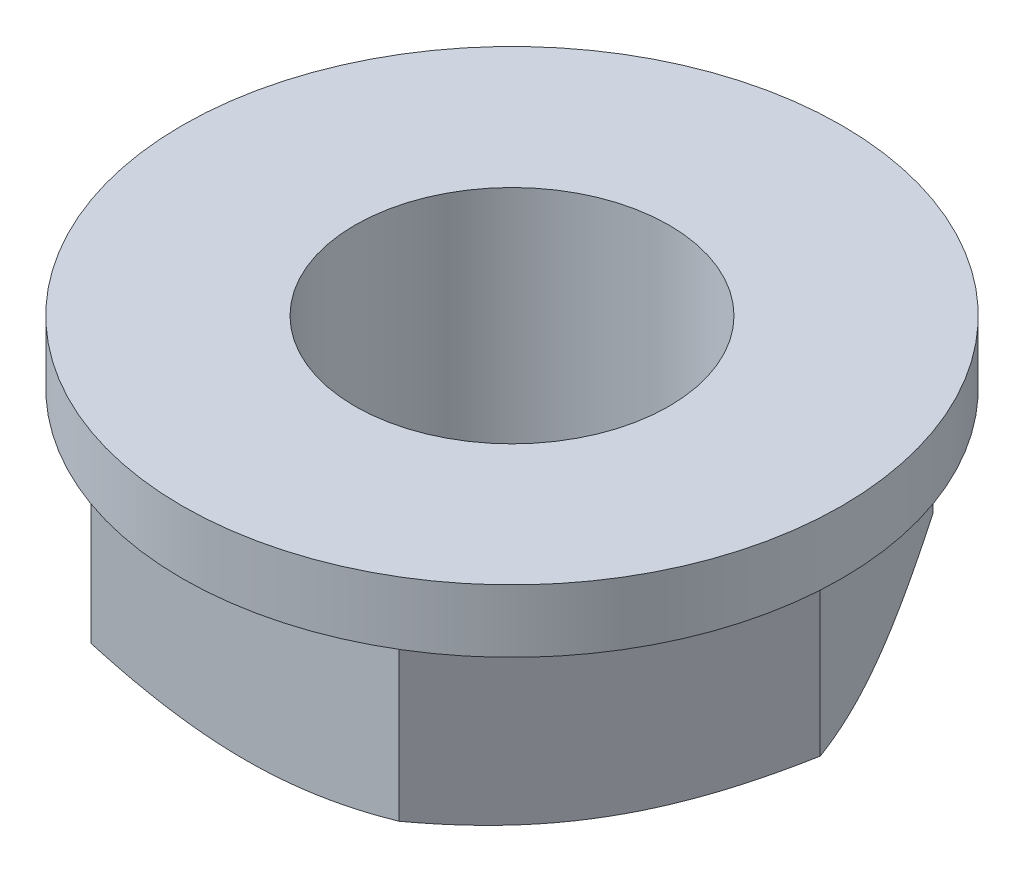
ISO-10303-21;
HEADER;
FILE_DESCRIPTION(('STEP AP214'),'2;1');
FILE_NAME('part.step','',(''),(''),'','','');
FILE_SCHEMA(('AUTOMOTIVE_DESIGN { 1 0 10303 214 1 1 1 1 }'));
ENDSEC;
DATA;
#1=APPLICATION_CONTEXT('core data for automotive mechanical design processes');
#2=APPLICATION_PROTOCOL_DEFINITION('international standard','automotive_design',2000,#1);
#3=PRODUCT_CONTEXT('',#1,'mechanical');
#4=PRODUCT('Part','Part','',(#3));
#5=PRODUCT_RELATED_PRODUCT_CATEGORY('part','',(#4));
#6=PRODUCT_DEFINITION_FORMATION('','',#4);
#7=PRODUCT_DEFINITION_CONTEXT('part definition',#1,'design');
#8=PRODUCT_DEFINITION('design','',#6,#7);
#9=PRODUCT_DEFINITION_SHAPE('','',#8);
#10=(LENGTH_UNIT() NAMED_UNIT(*) SI_UNIT(.MILLI.,.METRE.));
#11=(NAMED_UNIT(*) PLANE_ANGLE_UNIT() SI_UNIT($,.RADIAN.));
#12=(NAMED_UNIT(*) SI_UNIT($,.STERADIAN.) SOLID_ANGLE_UNIT());
#13=UNCERTAINTY_MEASURE_WITH_UNIT(LENGTH_MEASURE(1.E-05),#10,'distance_accuracy_value','');
#14=(GEOMETRIC_REPRESENTATION_CONTEXT(3) GLOBAL_UNCERTAINTY_ASSIGNED_CONTEXT((#13)) GLOBAL_UNIT_ASSIGNED_CONTEXT((#10,
#11,#12)) REPRESENTATION_CONTEXT('',''));
#15=CARTESIAN_POINT('',(0.,0.,0.));
#16=DIRECTION('',(0.,0.,1.));
#17=DIRECTION('',(1.,0.,0.));
#18=AXIS2_PLACEMENT_3D('',#15,#16,#17);
#19=CARTESIAN_POINT('',(0.,-7.6196705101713,0.));
#20=DIRECTION('',(0.,1.,0.));
#21=DIRECTION('',(-1.,0.,0.));
#22=AXIS2_PLACEMENT_3D('',#19,#20,#21);
#23=CONICAL_SURFACE('',#22,9.15875,1.0471975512);
#24=CARTESIAN_POINT('',(7.36121593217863,-8.00000000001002,-4.25000000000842));
#25=CARTESIAN_POINT('',(8.50000000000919,-8.00000000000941,-2.27756813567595));
#26=CARTESIAN_POINT('',(9.81495457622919,-7.24081062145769,2.25340941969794E-12));
#27=(BOUNDED_CURVE() B_SPLINE_CURVE(2,(#24,#25,#26),.UNSPECIFIED.,.F.,
.F.) B_SPLINE_CURVE_WITH_KNOTS((3,3),(4.98381893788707,9.96299728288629),
.UNSPECIFIED.) CURVE() GEOMETRIC_REPRESENTATION_ITEM() RATIONAL_B_SPLINE_CURVE((1.00000000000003,
1.03799156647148,1.00007075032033)) REPRESENTATION_ITEM(''));
#28=CARTESIAN_POINT('',(7.36121593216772,-8.,-4.25));
#29=VERTEX_POINT('',#28);
#30=CARTESIAN_POINT('',(9.81495457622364,-7.2408106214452,0.));
#31=VERTEX_POINT('',#30);
#32=EDGE_CURVE('E30',#29,#31,#27,.T.);
#33=ORIENTED_EDGE('',*,*,#32,.T.);
#34=CARTESIAN_POINT('',(9.81495457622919,-7.24081062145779,-2.25483529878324E-12));
#35=CARTESIAN_POINT('',(8.50000000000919,-8.0000000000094,2.27756813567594));
#36=CARTESIAN_POINT('',(7.36121593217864,-8.00000000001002,4.25000000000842));
#37=(BOUNDED_CURVE() B_SPLINE_CURVE(2,(#34,#35,#36),.UNSPECIFIED.,.F.,
.F.) B_SPLINE_CURVE_WITH_KNOTS((3,3),(0.00464059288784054,4.98381893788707),
.UNSPECIFIED.) CURVE() GEOMETRIC_REPRESENTATION_ITEM() RATIONAL_B_SPLINE_CURVE((1.00007075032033,
1.03799156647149,1.00000000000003)) REPRESENTATION_ITEM(''));
#38=CARTESIAN_POINT('',(7.36121593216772,-8.,4.25));
#39=VERTEX_POINT('',#38);
#40=EDGE_CURVE('E146',#31,#39,#37,.T.);
#41=ORIENTED_EDGE('',*,*,#40,.T.);
#42=CARTESIAN_POINT('',(0.,-8.00000000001,0.));
#43=DIRECTION('',(0.,-1.,0.));
#44=DIRECTION('',(-1.,0.,0.));
#45=AXIS2_PLACEMENT_3D('',#42,#43,#44);
#46=CIRCLE('',#45,8.5);
#47=EDGE_CURVE('E22',#29,#39,#46,.T.);
#48=ORIENTED_EDGE('',*,*,#47,.F.);
#49=EDGE_LOOP('',(#33,#41,#48));
#50=FACE_BOUND('',#49,.T.);
#51=ADVANCED_FACE('F18',(#50),#23,.T.);
#52=CARTESIAN_POINT('',(-7.36121593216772,-8.,4.25));
#53=VERTEX_POINT('',#52);
#54=CARTESIAN_POINT('',(-7.36121593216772,-8.,-4.25));
#55=VERTEX_POINT('',#54);
#56=EDGE_CURVE('E145',#53,#55,#46,.T.);
#57=ORIENTED_EDGE('',*,*,#56,.F.);
#58=CARTESIAN_POINT('',(-7.36121593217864,-8.00000000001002,4.25000000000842));
#59=CARTESIAN_POINT('',(-8.50000000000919,-8.00000000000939,2.27756813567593));
#60=CARTESIAN_POINT('',(-9.81495457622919,-7.24081062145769,-2.25649494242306E-12));
#61=(BOUNDED_CURVE() B_SPLINE_CURVE(2,(#58,#59,#60),.UNSPECIFIED.,.F.,
.F.) B_SPLINE_CURVE_WITH_KNOTS((3,3),(4.98381893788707,9.9629972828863),
.UNSPECIFIED.) CURVE() GEOMETRIC_REPRESENTATION_ITEM() RATIONAL_B_SPLINE_CURVE((1.00000000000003,
1.0379915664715,1.00007075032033)) REPRESENTATION_ITEM(''));
#62=CARTESIAN_POINT('',(-9.81495457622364,-7.2408106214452,0.));
#63=VERTEX_POINT('',#62);
#64=EDGE_CURVE('E131',#53,#63,#61,.T.);
#65=ORIENTED_EDGE('',*,*,#64,.T.);
#66=CARTESIAN_POINT('',(-9.81495457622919,-7.24081062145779,2.25307782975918E-12));
#67=CARTESIAN_POINT('',(-8.50000000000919,-8.0000000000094,-2.27756813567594));
#68=CARTESIAN_POINT('',(-7.36121593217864,-8.00000000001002,-4.25000000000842));
#69=(BOUNDED_CURVE() B_SPLINE_CURVE(2,(#66,#67,#68),.UNSPECIFIED.,.F.,
.F.) B_SPLINE_CURVE_WITH_KNOTS((3,3),(0.00464059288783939,4.98381893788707),
.UNSPECIFIED.) CURVE() GEOMETRIC_REPRESENTATION_ITEM() RATIONAL_B_SPLINE_CURVE((1.00007075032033,
1.03799156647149,1.00000000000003)) REPRESENTATION_ITEM(''));
#70=EDGE_CURVE('E39',#63,#55,#69,.T.);
#71=ORIENTED_EDGE('',*,*,#70,.T.);
#72=EDGE_LOOP('',(#57,#65,#71));
#73=FACE_BOUND('',#72,.T.);
#74=ADVANCED_FACE('F20',(#73),#23,.T.);
#75=CARTESIAN_POINT('',(0.,-1.,0.));
#76=DIRECTION('',(0.,-1.,0.));
#77=DIRECTION('',(1.,0.,0.));
#78=AXIS2_PLACEMENT_3D('',#75,#76,#77);
#79=CYLINDRICAL_SURFACE('',#78,10.5);
#80=CARTESIAN_POINT('',(0.,-1.00006808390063E-11,0.));
#81=DIRECTION('',(0.,1.,0.));
#82=DIRECTION('',(1.,0.,0.));
#83=AXIS2_PLACEMENT_3D('',#80,#81,#82);
#84=CIRCLE('',#83,10.5);
#85=CARTESIAN_POINT('',(10.5,-1.00006808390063E-11,0.));
#86=VERTEX_POINT('',#85);
#87=EDGE_CURVE('E253',#86,#86,#84,.T.);
#88=ORIENTED_EDGE('',*,*,#87,.F.);
#89=EDGE_LOOP('',(#88));
#90=FACE_BOUND('',#89,.T.);
#91=CARTESIAN_POINT('',(0.,-2.00000000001,0.));
#92=DIRECTION('',(0.,1.,0.));
#93=DIRECTION('',(1.,0.,0.));
#94=AXIS2_PLACEMENT_3D('',#91,#92,#93);
#95=CIRCLE('',#94,10.5);
#96=CARTESIAN_POINT('',(10.5,-2.00000000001,0.));
#97=VERTEX_POINT('',#96);
#98=EDGE_CURVE('E236',#97,#97,#95,.T.);
#99=ORIENTED_EDGE('',*,*,#98,.T.);
#100=EDGE_LOOP('',(#99));
#101=FACE_BOUND('',#100,.T.);
#102=ADVANCED_FACE('F363',(#90,#101),#79,.T.);
#103=CARTESIAN_POINT('',(4.90747728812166,-7.24081062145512,-8.50000000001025));
#104=CARTESIAN_POINT('',(6.22243186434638,-8.00000000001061,-6.22243186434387));
#105=CARTESIAN_POINT('',(7.36121593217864,-8.00000000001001,-4.25000000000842));
#106=(BOUNDED_CURVE() B_SPLINE_CURVE(2,(#103,#104,#105),.UNSPECIFIED.,.F.,
.F.) B_SPLINE_CURVE_WITH_KNOTS((3,3),(0.00464059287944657,4.98381893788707),
.UNSPECIFIED.) CURVE() GEOMETRIC_REPRESENTATION_ITEM() RATIONAL_B_SPLINE_CURVE((1.0000707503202,
1.03799156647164,0.999999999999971)) REPRESENTATION_ITEM(''));
#107=CARTESIAN_POINT('',(4.90747728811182,-7.2408106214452,-8.5));
#108=VERTEX_POINT('',#107);
#109=EDGE_CURVE('E11',#108,#29,#106,.T.);
#110=ORIENTED_EDGE('',*,*,#109,.T.);
#111=CARTESIAN_POINT('',(0.,-8.,-8.5));
#112=VERTEX_POINT('',#111);
#113=EDGE_CURVE('E158',#112,#29,#46,.T.);
#114=ORIENTED_EDGE('',*,*,#113,.F.);
#115=CARTESIAN_POINT('',(0.,-8.00000000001,-8.50000000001));
#116=CARTESIAN_POINT('',(2.2775681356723,-8.00000000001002,-8.50000000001));
#117=CARTESIAN_POINT('',(4.90747728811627,-7.2408106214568,-8.50000000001));
#118=(BOUNDED_CURVE() B_SPLINE_CURVE(2,(#115,#116,#117),.UNSPECIFIED.,.F.,
.F.) B_SPLINE_CURVE_WITH_KNOTS((3,3),(4.98381893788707,9.96299728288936),
.UNSPECIFIED.) CURVE() GEOMETRIC_REPRESENTATION_ITEM() RATIONAL_B_SPLINE_CURVE((1.,
1.03799156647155,1.00007075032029)) REPRESENTATION_ITEM(''));
#119=EDGE_CURVE('E93',#112,#108,#118,.T.);
#120=ORIENTED_EDGE('',*,*,#119,.T.);
#121=EDGE_LOOP('',(#110,#114,#120));
#122=FACE_BOUND('',#121,.T.);
#123=ADVANCED_FACE('F419',(#122),#23,.T.);
#124=CARTESIAN_POINT('',(7.36121593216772,1.,-4.25));
#125=DIRECTION('',(0.866025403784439,0.,-0.5));
#126=DIRECTION('',(0.,-1.,0.));
#127=AXIS2_PLACEMENT_3D('',#124,#125,#126);
#128=PLANE('',#127);
#129=DIRECTION('',(0.50000000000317,0.,0.866025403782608));
#130=VECTOR('',#129,1.);
#131=CARTESIAN_POINT('',(8.34559093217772,-2.00000000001,-2.54501248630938));
#132=LINE('',#131,#130);
#133=CARTESIAN_POINT('',(4.90747728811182,-2.,-8.5));
#134=VERTEX_POINT('',#133);
#135=CARTESIAN_POINT('',(9.81495457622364,-2.,0.));
#136=VERTEX_POINT('',#135);
#137=EDGE_CURVE('E134',#134,#136,#132,.T.);
#138=ORIENTED_EDGE('',*,*,#137,.T.);
#139=DIRECTION('',(0.,-1.,0.));
#140=VECTOR('',#139,1.);
#141=CARTESIAN_POINT('',(9.81495457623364,0.99999999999,-1.00018029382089E-11));
#142=LINE('',#141,#140);
#143=EDGE_CURVE('E142',#136,#31,#142,.T.);
#144=ORIENTED_EDGE('',*,*,#143,.T.);
#145=ORIENTED_EDGE('',*,*,#32,.F.);
#146=ORIENTED_EDGE('',*,*,#109,.F.);
#147=DIRECTION('',(0.,-1.,0.));
#148=VECTOR('',#147,1.);
#149=CARTESIAN_POINT('',(4.90747728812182,0.99999999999,-8.50000000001));
#150=LINE('',#149,#148);
#151=EDGE_CURVE('E149',#134,#108,#150,.T.);
#152=ORIENTED_EDGE('',*,*,#151,.F.);
#153=EDGE_LOOP('',(#138,#144,#145,#146,#152));
#154=FACE_BOUND('',#153,.T.);
#155=ADVANCED_FACE('F325',(#154),#128,.T.);
#156=CARTESIAN_POINT('',(-7.36121593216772,1.,-4.25));
#157=DIRECTION('',(-0.866025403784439,0.,-0.5));
#158=DIRECTION('',(-0.5,0.,0.866025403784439));
#159=AXIS2_PLACEMENT_3D('',#156,#157,#158);
#160=PLANE('',#159);
#161=DIRECTION('',(0.50000000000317,0.,-0.866025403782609));
#162=VECTOR('',#161,1.);
#163=CARTESIAN_POINT('',(-6.37684093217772,-2.00000000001,-5.95498751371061));
#164=LINE('',#163,#162);
#165=CARTESIAN_POINT('',(-9.81495457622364,-2.,0.));
#166=VERTEX_POINT('',#165);
#167=CARTESIAN_POINT('',(-4.90747728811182,-2.,-8.5));
#168=VERTEX_POINT('',#167);
#169=EDGE_CURVE('E87',#166,#168,#164,.T.);
#170=ORIENTED_EDGE('',*,*,#169,.T.);
#171=DIRECTION('',(0.,-1.,0.));
#172=VECTOR('',#171,1.);
#173=CARTESIAN_POINT('',(-4.90747728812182,0.99999999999,-8.50000000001));
#174=LINE('',#173,#172);
#175=CARTESIAN_POINT('',(-4.90747728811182,-7.2408106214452,-8.5));
#176=VERTEX_POINT('',#175);
#177=EDGE_CURVE('E81',#168,#176,#174,.T.);
#178=ORIENTED_EDGE('',*,*,#177,.T.);
#179=CARTESIAN_POINT('',(-7.36121593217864,-8.00000000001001,-4.25000000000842));
#180=CARTESIAN_POINT('',(-6.22243186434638,-8.00000000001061,-6.22243186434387));
#181=CARTESIAN_POINT('',(-4.90747728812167,-7.24081062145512,-8.50000000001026));
#182=(BOUNDED_CURVE() B_SPLINE_CURVE(2,(#179,#180,#181),.UNSPECIFIED.,.F.,
.F.) B_SPLINE_CURVE_WITH_KNOTS((3,3),(4.98381893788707,9.96299728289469),
.UNSPECIFIED.) CURVE() GEOMETRIC_REPRESENTATION_ITEM() RATIONAL_B_SPLINE_CURVE((0.999999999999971,
1.03799156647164,1.0000707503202)) REPRESENTATION_ITEM(''));
#183=EDGE_CURVE('E85',#55,#176,#182,.T.);
#184=ORIENTED_EDGE('',*,*,#183,.F.);
#185=ORIENTED_EDGE('',*,*,#70,.F.);
#186=DIRECTION('',(0.,-1.,0.));
#187=VECTOR('',#186,1.);
#188=CARTESIAN_POINT('',(-9.81495457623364,0.99999999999,1.00006009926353E-11));
#189=LINE('',#188,#187);
#190=EDGE_CURVE('E92',#166,#63,#189,.T.);
#191=ORIENTED_EDGE('',*,*,#190,.F.);
#192=EDGE_LOOP('',(#170,#178,#184,#185,#191));
#193=FACE_BOUND('',#192,.T.);
#194=ADVANCED_FACE('F83',(#193),#160,.T.);
#195=CARTESIAN_POINT('',(-7.36121593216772,1.,4.25));
#196=DIRECTION('',(-0.866025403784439,0.,0.5));
#197=DIRECTION('',(0.,1.,0.));
#198=AXIS2_PLACEMENT_3D('',#195,#196,#197);
#199=PLANE('',#198);
#200=DIRECTION('',(-0.50000000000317,0.,-0.866025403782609));
#201=VECTOR('',#200,1.);
#202=CARTESIAN_POINT('',(-6.37684093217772,-2.00000000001,5.95498751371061));
#203=LINE('',#202,#201);
#204=CARTESIAN_POINT('',(-4.90747728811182,-2.,8.5));
#205=VERTEX_POINT('',#204);
#206=EDGE_CURVE('E231',#205,#166,#203,.T.);
#207=ORIENTED_EDGE('',*,*,#206,.T.);
#208=ORIENTED_EDGE('',*,*,#190,.T.);
#209=ORIENTED_EDGE('',*,*,#64,.F.);
#210=CARTESIAN_POINT('',(-4.90747728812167,-7.24081062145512,8.50000000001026));
#211=CARTESIAN_POINT('',(-6.22243186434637,-8.00000000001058,6.22243186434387));
#212=CARTESIAN_POINT('',(-7.36121593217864,-8.00000000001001,4.25000000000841));
#213=(BOUNDED_CURVE() B_SPLINE_CURVE(2,(#210,#211,#212),.UNSPECIFIED.,.F.,
.F.) B_SPLINE_CURVE_WITH_KNOTS((3,3),(0.00464059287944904,4.98381893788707),
.UNSPECIFIED.) CURVE() GEOMETRIC_REPRESENTATION_ITEM() RATIONAL_B_SPLINE_CURVE((1.0000707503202,
1.03799156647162,0.999999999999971)) REPRESENTATION_ITEM(''));
#214=CARTESIAN_POINT('',(-4.90747728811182,-7.2408106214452,8.5));
#215=VERTEX_POINT('',#214);
#216=EDGE_CURVE('E117',#215,#53,#213,.T.);
#217=ORIENTED_EDGE('',*,*,#216,.F.);
#218=DIRECTION('',(0.,-1.,0.));
#219=VECTOR('',#218,1.);
#220=CARTESIAN_POINT('',(-4.90747728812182,0.99999999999,8.50000000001));
#221=LINE('',#220,#219);
#222=EDGE_CURVE('E225',#205,#215,#221,.T.);
#223=ORIENTED_EDGE('',*,*,#222,.F.);
#224=EDGE_LOOP('',(#207,#208,#209,#217,#223));
#225=FACE_BOUND('',#224,.T.);
#226=ADVANCED_FACE('F444',(#225),#199,.T.);
#227=CARTESIAN_POINT('',(0.,1.,-8.5));
#228=DIRECTION('',(0.,0.,-1.));
#229=DIRECTION('',(0.,-1.,0.));
#230=AXIS2_PLACEMENT_3D('',#227,#228,#229);
#231=PLANE('',#230);
#232=DIRECTION('',(1.,0.,0.));
#233=VECTOR('',#232,1.);
#234=CARTESIAN_POINT('',(3.93750000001,-2.00000000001,-8.50000000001));
#235=LINE('',#234,#233);
#236=EDGE_CURVE('E138',#168,#134,#235,.T.);
#237=ORIENTED_EDGE('',*,*,#236,.T.);
#238=ORIENTED_EDGE('',*,*,#151,.T.);
#239=ORIENTED_EDGE('',*,*,#119,.F.);
#240=CARTESIAN_POINT('',(-4.90747728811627,-7.2408106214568,-8.50000000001));
#241=CARTESIAN_POINT('',(-2.2775681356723,-8.00000000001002,-8.50000000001));
#242=CARTESIAN_POINT('',(0.,-8.00000000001,-8.50000000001));
#243=(BOUNDED_CURVE() B_SPLINE_CURVE(2,(#240,#241,#242),.UNSPECIFIED.,.F.,
.F.) B_SPLINE_CURVE_WITH_KNOTS((3,3),(0.00464059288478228,4.98381893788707),
.UNSPECIFIED.) CURVE() GEOMETRIC_REPRESENTATION_ITEM() RATIONAL_B_SPLINE_CURVE((1.00007075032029,
1.03799156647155,1.)) REPRESENTATION_ITEM(''));
#244=EDGE_CURVE('E96',#176,#112,#243,.T.);
#245=ORIENTED_EDGE('',*,*,#244,.F.);
#246=ORIENTED_EDGE('',*,*,#177,.F.);
#247=EDGE_LOOP('',(#237,#238,#239,#245,#246));
#248=FACE_BOUND('',#247,.T.);
#249=ADVANCED_FACE('F97',(#248),#231,.T.);
#250=CARTESIAN_POINT('',(-6.75,-8.,0.));
#251=DIRECTION('',(0.,-1.,0.));
#252=DIRECTION('',(-1.,0.,0.));
#253=AXIS2_PLACEMENT_3D('',#250,#251,#252);
#254=PLANE('',#253);
#255=CARTESIAN_POINT('',(0.,-8.,0.));
#256=DIRECTION('',(0.,-1.,0.));
#257=DIRECTION('',(1.,0.,0.));
#258=AXIS2_PLACEMENT_3D('',#255,#256,#257);
#259=CIRCLE('',#258,5.);
#260=CARTESIAN_POINT('',(5.,-8.,0.));
#261=VERTEX_POINT('',#260);
#262=EDGE_CURVE('E232',#261,#261,#259,.T.);
#263=ORIENTED_EDGE('',*,*,#262,.F.);
#264=EDGE_LOOP('',(#263));
#265=FACE_BOUND('',#264,.T.);
#266=CARTESIAN_POINT('',(0.,-8.,8.5));
#267=VERTEX_POINT('',#266);
#268=EDGE_CURVE('E109',#267,#53,#46,.T.);
#269=ORIENTED_EDGE('',*,*,#268,.T.);
#270=ORIENTED_EDGE('',*,*,#56,.T.);
#271=EDGE_CURVE('E104',#55,#112,#46,.T.);
#272=ORIENTED_EDGE('',*,*,#271,.T.);
#273=ORIENTED_EDGE('',*,*,#113,.T.);
#274=ORIENTED_EDGE('',*,*,#47,.T.);
#275=EDGE_CURVE('E175',#39,#267,#46,.T.);
#276=ORIENTED_EDGE('',*,*,#275,.T.);
#277=EDGE_LOOP('',(#269,#270,#272,#273,#274,#276));
#278=FACE_BOUND('',#277,.T.);
#279=ADVANCED_FACE('F350',(#265,#278),#254,.T.);
#280=CARTESIAN_POINT('',(7.36121593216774,1.,4.25));
#281=DIRECTION('',(0.866025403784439,0.,0.5));
#282=DIRECTION('',(0.,-1.,0.));
#283=AXIS2_PLACEMENT_3D('',#280,#281,#282);
#284=PLANE('',#283);
#285=DIRECTION('',(-0.50000000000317,0.,0.866025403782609));
#286=VECTOR('',#285,1.);
#287=CARTESIAN_POINT('',(8.34559093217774,-2.00000000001,2.54501248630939));
#288=LINE('',#287,#286);
#289=CARTESIAN_POINT('',(4.90747728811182,-2.,8.5));
#290=VERTEX_POINT('',#289);
#291=EDGE_CURVE('E139',#136,#290,#288,.T.);
#292=ORIENTED_EDGE('',*,*,#291,.T.);
#293=DIRECTION('',(0.,-1.,0.));
#294=VECTOR('',#293,1.);
#295=CARTESIAN_POINT('',(4.90747728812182,0.99999999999,8.50000000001));
#296=LINE('',#295,#294);
#297=CARTESIAN_POINT('',(4.90747728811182,-7.2408106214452,8.5));
#298=VERTEX_POINT('',#297);
#299=EDGE_CURVE('E193',#290,#298,#296,.T.);
#300=ORIENTED_EDGE('',*,*,#299,.T.);
#301=CARTESIAN_POINT('',(7.36121593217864,-8.00000000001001,4.25000000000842));
#302=CARTESIAN_POINT('',(6.22243186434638,-8.00000000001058,6.22243186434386));
#303=CARTESIAN_POINT('',(4.90747728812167,-7.24081062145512,8.50000000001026));
#304=(BOUNDED_CURVE() B_SPLINE_CURVE(2,(#301,#302,#303),.UNSPECIFIED.,.F.,
.F.) B_SPLINE_CURVE_WITH_KNOTS((3,3),(4.98381893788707,9.96299728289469),
.UNSPECIFIED.) CURVE() GEOMETRIC_REPRESENTATION_ITEM() RATIONAL_B_SPLINE_CURVE((0.999999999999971,
1.03799156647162,1.0000707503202)) REPRESENTATION_ITEM(''));
#305=EDGE_CURVE('E184',#39,#298,#304,.T.);
#306=ORIENTED_EDGE('',*,*,#305,.F.);
#307=ORIENTED_EDGE('',*,*,#40,.F.);
#308=ORIENTED_EDGE('',*,*,#143,.F.);
#309=EDGE_LOOP('',(#292,#300,#306,#307,#308));
#310=FACE_BOUND('',#309,.T.);
#311=ADVANCED_FACE('F344',(#310),#284,.T.);
#312=CARTESIAN_POINT('',(4.90747728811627,-7.2408106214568,8.50000000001));
#313=CARTESIAN_POINT('',(2.2775681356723,-8.00000000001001,8.50000000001));
#314=CARTESIAN_POINT('',(0.,-8.00000000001,8.50000000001));
#315=(BOUNDED_CURVE() B_SPLINE_CURVE(2,(#312,#313,#314),.UNSPECIFIED.,.F.,
.F.) B_SPLINE_CURVE_WITH_KNOTS((3,3),(0.00464059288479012,4.98381893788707),
.UNSPECIFIED.) CURVE() GEOMETRIC_REPRESENTATION_ITEM() RATIONAL_B_SPLINE_CURVE((1.00007075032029,
1.03799156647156,1.)) REPRESENTATION_ITEM(''));
#316=EDGE_CURVE('E197',#298,#267,#315,.T.);
#317=ORIENTED_EDGE('',*,*,#316,.T.);
#318=ORIENTED_EDGE('',*,*,#275,.F.);
#319=ORIENTED_EDGE('',*,*,#305,.T.);
#320=EDGE_LOOP('',(#317,#318,#319));
#321=FACE_BOUND('',#320,.T.);
#322=ADVANCED_FACE('F249',(#321),#23,.T.);
#323=CARTESIAN_POINT('',(-7.40875,0.,0.));
#324=DIRECTION('',(0.,1.,0.));
#325=DIRECTION('',(1.,0.,0.));
#326=AXIS2_PLACEMENT_3D('',#323,#324,#325);
#327=PLANE('',#326);
#328=CARTESIAN_POINT('',(0.,0.,0.));
#329=DIRECTION('',(0.,1.,0.));
#330=DIRECTION('',(0.,0.,1.));
#331=AXIS2_PLACEMENT_3D('',#328,#329,#330);
#332=CIRCLE('',#331,5.);
#333=CARTESIAN_POINT('',(0.,0.,5.));
#334=VERTEX_POINT('',#333);
#335=EDGE_CURVE('E237',#334,#334,#332,.T.);
#336=ORIENTED_EDGE('',*,*,#335,.F.);
#337=EDGE_LOOP('',(#336));
#338=FACE_BOUND('',#337,.T.);
#339=ORIENTED_EDGE('',*,*,#87,.T.);
#340=EDGE_LOOP('',(#339));
#341=FACE_BOUND('',#340,.T.);
#342=ADVANCED_FACE('F246',(#338,#341),#327,.T.);
#343=ORIENTED_EDGE('',*,*,#183,.T.);
#344=ORIENTED_EDGE('',*,*,#244,.T.);
#345=ORIENTED_EDGE('',*,*,#271,.F.);
#346=EDGE_LOOP('',(#343,#344,#345));
#347=FACE_BOUND('',#346,.T.);
#348=ADVANCED_FACE('F106',(#347),#23,.T.);
#349=CARTESIAN_POINT('',(0.,-8.00000000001,8.50000000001));
#350=CARTESIAN_POINT('',(-2.2775681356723,-8.00000000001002,8.50000000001));
#351=CARTESIAN_POINT('',(-4.90747728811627,-7.2408106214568,8.50000000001));
#352=(BOUNDED_CURVE() B_SPLINE_CURVE(2,(#349,#350,#351),.UNSPECIFIED.,.F.,
.F.) B_SPLINE_CURVE_WITH_KNOTS((3,3),(4.98381893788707,9.96299728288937),
.UNSPECIFIED.) CURVE() GEOMETRIC_REPRESENTATION_ITEM() RATIONAL_B_SPLINE_CURVE((1.,
1.03799156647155,1.00007075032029)) REPRESENTATION_ITEM(''));
#353=EDGE_CURVE('E214',#267,#215,#352,.T.);
#354=ORIENTED_EDGE('',*,*,#353,.T.);
#355=ORIENTED_EDGE('',*,*,#216,.T.);
#356=ORIENTED_EDGE('',*,*,#268,.F.);
#357=EDGE_LOOP('',(#354,#355,#356));
#358=FACE_BOUND('',#357,.T.);
#359=ADVANCED_FACE('F348',(#358),#23,.T.);
#360=CARTESIAN_POINT('',(0.,1.,8.5));
#361=DIRECTION('',(0.,0.,1.));
#362=DIRECTION('',(1.,0.,0.));
#363=AXIS2_PLACEMENT_3D('',#360,#361,#362);
#364=PLANE('',#363);
#365=DIRECTION('',(-1.,0.,0.));
#366=VECTOR('',#365,1.);
#367=CARTESIAN_POINT('',(3.93750000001,-2.00000000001,8.50000000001));
#368=LINE('',#367,#366);
#369=EDGE_CURVE('E203',#290,#205,#368,.T.);
#370=ORIENTED_EDGE('',*,*,#369,.T.);
#371=ORIENTED_EDGE('',*,*,#222,.T.);
#372=ORIENTED_EDGE('',*,*,#353,.F.);
#373=ORIENTED_EDGE('',*,*,#316,.F.);
#374=ORIENTED_EDGE('',*,*,#299,.F.);
#375=EDGE_LOOP('',(#370,#371,#372,#373,#374));
#376=FACE_BOUND('',#375,.T.);
#377=ADVANCED_FACE('F345',(#376),#364,.T.);
#378=CARTESIAN_POINT('',(7.875,-2.,0.));
#379=DIRECTION('',(0.,-1.,0.));
#380=DIRECTION('',(0.,0.,-1.));
#381=AXIS2_PLACEMENT_3D('',#378,#379,#380);
#382=PLANE('',#381);
#383=ORIENTED_EDGE('',*,*,#206,.F.);
#384=ORIENTED_EDGE('',*,*,#369,.F.);
#385=ORIENTED_EDGE('',*,*,#291,.F.);
#386=ORIENTED_EDGE('',*,*,#137,.F.);
#387=ORIENTED_EDGE('',*,*,#236,.F.);
#388=ORIENTED_EDGE('',*,*,#169,.F.);
#389=EDGE_LOOP('',(#383,#384,#385,#386,#387,#388));
#390=FACE_BOUND('',#389,.T.);
#391=ORIENTED_EDGE('',*,*,#98,.F.);
#392=EDGE_LOOP('',(#391));
#393=FACE_BOUND('',#392,.T.);
#394=ADVANCED_FACE('F321',(#390,#393),#382,.T.);
#395=CARTESIAN_POINT('',(0.,-8.0025,0.));
#396=DIRECTION('',(0.,1.,0.));
#397=DIRECTION('',(0.,0.,1.));
#398=AXIS2_PLACEMENT_3D('',#395,#396,#397);
#399=CYLINDRICAL_SURFACE('',#398,5.);
#400=ORIENTED_EDGE('',*,*,#262,.T.);
#401=EDGE_LOOP('',(#400));
#402=FACE_BOUND('',#401,.T.);
#403=ORIENTED_EDGE('',*,*,#335,.T.);
#404=EDGE_LOOP('',(#403));
#405=FACE_BOUND('',#404,.T.);
#406=ADVANCED_FACE('F244',(#402,#405),#399,.F.);
#407=CLOSED_SHELL('',(#51,#74,#102,#123,#155,#194,#226,#249,#279,#311,#322,#342,#348,#359,#377,
#394,#406));
#408=MANIFOLD_SOLID_BREP('B1',#407);
#409=ADVANCED_BREP_SHAPE_REPRESENTATION('',(#18,#408),#14);
#410=SHAPE_DEFINITION_REPRESENTATION(#9,#409);
ENDSEC;
END-ISO-10303-21;
